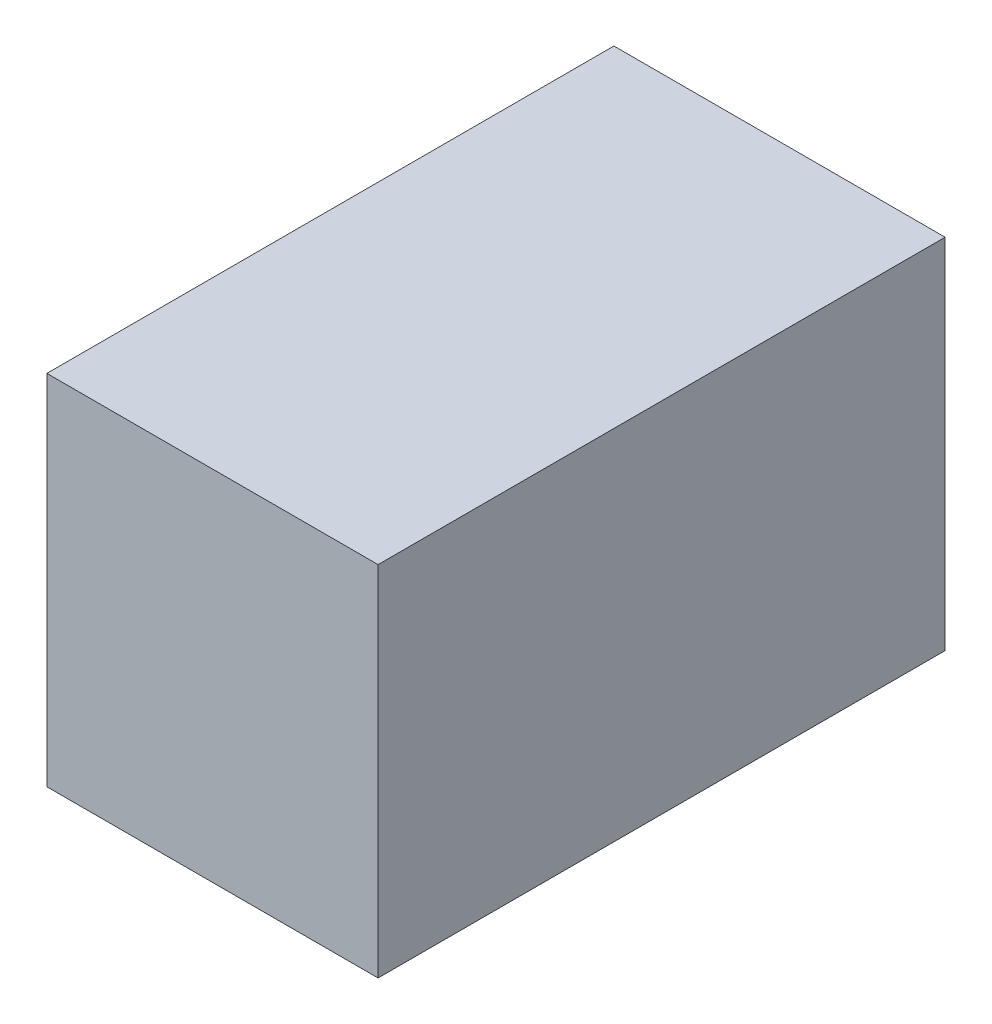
ISO-10303-21;
HEADER;
FILE_DESCRIPTION(('STEP AP214'),'2;1');
FILE_NAME('part.step','',(''),(''),'','','');
FILE_SCHEMA(('AUTOMOTIVE_DESIGN { 1 0 10303 214 1 1 1 1 }'));
ENDSEC;
DATA;
#1=APPLICATION_CONTEXT('core data for automotive mechanical design processes');
#2=APPLICATION_PROTOCOL_DEFINITION('international standard','automotive_design',2000,#1);
#3=PRODUCT_CONTEXT('',#1,'mechanical');
#4=PRODUCT('Part','Part','',(#3));
#5=PRODUCT_RELATED_PRODUCT_CATEGORY('part','',(#4));
#6=PRODUCT_DEFINITION_FORMATION('','',#4);
#7=PRODUCT_DEFINITION_CONTEXT('part definition',#1,'design');
#8=PRODUCT_DEFINITION('design','',#6,#7);
#9=PRODUCT_DEFINITION_SHAPE('','',#8);
#10=(LENGTH_UNIT() NAMED_UNIT(*) SI_UNIT(.MILLI.,.METRE.));
#11=(NAMED_UNIT(*) PLANE_ANGLE_UNIT() SI_UNIT($,.RADIAN.));
#12=(NAMED_UNIT(*) SI_UNIT($,.STERADIAN.) SOLID_ANGLE_UNIT());
#13=UNCERTAINTY_MEASURE_WITH_UNIT(LENGTH_MEASURE(1.E-05),#10,'distance_accuracy_value','');
#14=(GEOMETRIC_REPRESENTATION_CONTEXT(3) GLOBAL_UNCERTAINTY_ASSIGNED_CONTEXT((#13)) GLOBAL_UNIT_ASSIGNED_CONTEXT((#10,
#11,#12)) REPRESENTATION_CONTEXT('',''));
#15=CARTESIAN_POINT('',(0.,0.,0.));
#16=DIRECTION('',(0.,0.,1.));
#17=DIRECTION('',(1.,0.,0.));
#18=AXIS2_PLACEMENT_3D('',#15,#16,#17);
#19=CARTESIAN_POINT('',(2780.04847763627,-81.5627120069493,514.630582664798));
#20=DIRECTION('',(1.,0.,0.));
#21=DIRECTION('',(0.,0.,-1.));
#22=AXIS2_PLACEMENT_3D('',#19,#20,#21);
#23=PLANE('',#22);
#24=DIRECTION('',(0.,1.,0.));
#25=VECTOR('',#24,1.);
#26=CARTESIAN_POINT('',(2780.04847763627,-81.5627120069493,679.498));
#27=LINE('',#26,#25);
#28=CARTESIAN_POINT('',(2780.04847763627,-81.5627120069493,679.498));
#29=VERTEX_POINT('',#28);
#30=CARTESIAN_POINT('',(2780.04847763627,22.53033235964,679.498));
#31=VERTEX_POINT('',#30);
#32=EDGE_CURVE('E102',#29,#31,#27,.T.);
#33=ORIENTED_EDGE('',*,*,#32,.F.);
#34=DIRECTION('',(0.,0.,1.));
#35=VECTOR('',#34,1.);
#36=CARTESIAN_POINT('',(2780.04847763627,-81.5627120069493,514.630582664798));
#37=LINE('',#36,#35);
#38=CARTESIAN_POINT('',(2780.04847763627,-81.5627120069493,514.630582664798));
#39=VERTEX_POINT('',#38);
#40=EDGE_CURVE('E11',#39,#29,#37,.T.);
#41=ORIENTED_EDGE('',*,*,#40,.F.);
#42=DIRECTION('',(0.,1.,0.));
#43=VECTOR('',#42,1.);
#44=CARTESIAN_POINT('',(2780.04847763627,-81.5627120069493,514.630582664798));
#45=LINE('',#44,#43);
#46=CARTESIAN_POINT('',(2780.04847763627,22.53033235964,514.630582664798));
#47=VERTEX_POINT('',#46);
#48=EDGE_CURVE('E96',#39,#47,#45,.T.);
#49=ORIENTED_EDGE('',*,*,#48,.T.);
#50=DIRECTION('',(0.,0.,1.));
#51=VECTOR('',#50,1.);
#52=CARTESIAN_POINT('',(2780.04847763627,22.53033235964,514.630582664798));
#53=LINE('',#52,#51);
#54=EDGE_CURVE('E41',#47,#31,#53,.T.);
#55=ORIENTED_EDGE('',*,*,#54,.T.);
#56=EDGE_LOOP('',(#33,#41,#49,#55));
#57=FACE_BOUND('',#56,.T.);
#58=ADVANCED_FACE('F37',(#57),#23,.T.);
#59=CARTESIAN_POINT('',(2683.74960648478,-81.5627120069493,514.630582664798));
#60=DIRECTION('',(0.,-1.,0.));
#61=DIRECTION('',(0.,0.,-1.));
#62=AXIS2_PLACEMENT_3D('',#59,#60,#61);
#63=PLANE('',#62);
#64=DIRECTION('',(1.,0.,0.));
#65=VECTOR('',#64,1.);
#66=CARTESIAN_POINT('',(2683.74960648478,-81.5627120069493,679.498));
#67=LINE('',#66,#65);
#68=CARTESIAN_POINT('',(2683.74960648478,-81.5627120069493,679.498));
#69=VERTEX_POINT('',#68);
#70=EDGE_CURVE('E98',#69,#29,#67,.T.);
#71=ORIENTED_EDGE('',*,*,#70,.F.);
#72=DIRECTION('',(0.,0.,1.));
#73=VECTOR('',#72,1.);
#74=CARTESIAN_POINT('',(2683.74960648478,-81.5627120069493,514.630582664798));
#75=LINE('',#74,#73);
#76=CARTESIAN_POINT('',(2683.74960648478,-81.5627120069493,514.630582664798));
#77=VERTEX_POINT('',#76);
#78=EDGE_CURVE('E47',#77,#69,#75,.T.);
#79=ORIENTED_EDGE('',*,*,#78,.F.);
#80=DIRECTION('',(1.,0.,0.));
#81=VECTOR('',#80,1.);
#82=CARTESIAN_POINT('',(2683.74960648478,-81.5627120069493,514.630582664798));
#83=LINE('',#82,#81);
#84=EDGE_CURVE('E93',#77,#39,#83,.T.);
#85=ORIENTED_EDGE('',*,*,#84,.T.);
#86=ORIENTED_EDGE('',*,*,#40,.T.);
#87=EDGE_LOOP('',(#71,#79,#85,#86));
#88=FACE_BOUND('',#87,.T.);
#89=ADVANCED_FACE('F111',(#88),#63,.T.);
#90=CARTESIAN_POINT('',(2683.74960648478,-81.5627120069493,514.630582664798));
#91=DIRECTION('',(-1.,0.,0.));
#92=DIRECTION('',(0.,0.,1.));
#93=AXIS2_PLACEMENT_3D('',#90,#91,#92);
#94=PLANE('',#93);
#95=DIRECTION('',(0.,-1.,0.));
#96=VECTOR('',#95,1.);
#97=CARTESIAN_POINT('',(2683.74960648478,-81.5627120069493,679.498));
#98=LINE('',#97,#96);
#99=CARTESIAN_POINT('',(2683.74960648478,22.53033235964,679.498));
#100=VERTEX_POINT('',#99);
#101=EDGE_CURVE('E88',#100,#69,#98,.T.);
#102=ORIENTED_EDGE('',*,*,#101,.F.);
#103=DIRECTION('',(0.,0.,1.));
#104=VECTOR('',#103,1.);
#105=CARTESIAN_POINT('',(2683.74960648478,22.53033235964,514.630582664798));
#106=LINE('',#105,#104);
#107=CARTESIAN_POINT('',(2683.74960648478,22.53033235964,514.630582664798));
#108=VERTEX_POINT('',#107);
#109=EDGE_CURVE('E83',#108,#100,#106,.T.);
#110=ORIENTED_EDGE('',*,*,#109,.F.);
#111=DIRECTION('',(0.,-1.,0.));
#112=VECTOR('',#111,1.);
#113=CARTESIAN_POINT('',(2683.74960648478,-81.5627120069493,514.630582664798));
#114=LINE('',#113,#112);
#115=EDGE_CURVE('E86',#108,#77,#114,.T.);
#116=ORIENTED_EDGE('',*,*,#115,.T.);
#117=ORIENTED_EDGE('',*,*,#78,.T.);
#118=EDGE_LOOP('',(#102,#110,#116,#117));
#119=FACE_BOUND('',#118,.T.);
#120=ADVANCED_FACE('F85',(#119),#94,.T.);
#121=CARTESIAN_POINT('',(2683.74960648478,22.53033235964,514.630582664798));
#122=DIRECTION('',(0.,1.,0.));
#123=DIRECTION('',(0.,0.,1.));
#124=AXIS2_PLACEMENT_3D('',#121,#122,#123);
#125=PLANE('',#124);
#126=DIRECTION('',(-1.,0.,0.));
#127=VECTOR('',#126,1.);
#128=CARTESIAN_POINT('',(2683.74960648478,22.53033235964,679.498));
#129=LINE('',#128,#127);
#130=EDGE_CURVE('E105',#31,#100,#129,.T.);
#131=ORIENTED_EDGE('',*,*,#130,.F.);
#132=ORIENTED_EDGE('',*,*,#54,.F.);
#133=DIRECTION('',(-1.,0.,0.));
#134=VECTOR('',#133,1.);
#135=CARTESIAN_POINT('',(2683.74960648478,22.53033235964,514.630582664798));
#136=LINE('',#135,#134);
#137=EDGE_CURVE('E92',#47,#108,#136,.T.);
#138=ORIENTED_EDGE('',*,*,#137,.T.);
#139=ORIENTED_EDGE('',*,*,#109,.T.);
#140=EDGE_LOOP('',(#131,#132,#138,#139));
#141=FACE_BOUND('',#140,.T.);
#142=ADVANCED_FACE('F95',(#141),#125,.T.);
#143=CARTESIAN_POINT('',(2780.04847763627,22.53033235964,514.630582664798));
#144=DIRECTION('',(0.,0.,-1.));
#145=DIRECTION('',(-1.,0.,0.));
#146=AXIS2_PLACEMENT_3D('',#143,#144,#145);
#147=PLANE('',#146);
#148=ORIENTED_EDGE('',*,*,#48,.F.);
#149=ORIENTED_EDGE('',*,*,#84,.F.);
#150=ORIENTED_EDGE('',*,*,#115,.F.);
#151=ORIENTED_EDGE('',*,*,#137,.F.);
#152=EDGE_LOOP('',(#148,#149,#150,#151));
#153=FACE_BOUND('',#152,.T.);
#154=ADVANCED_FACE('F91',(#153),#147,.T.);
#155=CARTESIAN_POINT('',(2697.096706,-46.22109962,679.498));
#156=DIRECTION('',(0.,0.,-1.));
#157=DIRECTION('',(0.,1.,0.));
#158=AXIS2_PLACEMENT_3D('',#155,#156,#157);
#159=PLANE('',#158);
#160=ORIENTED_EDGE('',*,*,#32,.T.);
#161=ORIENTED_EDGE('',*,*,#130,.T.);
#162=ORIENTED_EDGE('',*,*,#101,.T.);
#163=ORIENTED_EDGE('',*,*,#70,.T.);
#164=EDGE_LOOP('',(#160,#161,#162,#163));
#165=FACE_BOUND('',#164,.T.);
#166=ADVANCED_FACE('F39',(#165),#159,.F.);
#167=CLOSED_SHELL('',(#58,#89,#120,#142,#154,#166));
#168=MANIFOLD_SOLID_BREP('B2',#167);
#169=ADVANCED_BREP_SHAPE_REPRESENTATION('',(#18,#168),#14);
#170=SHAPE_DEFINITION_REPRESENTATION(#9,#169);
ENDSEC;
END-ISO-10303-21;
